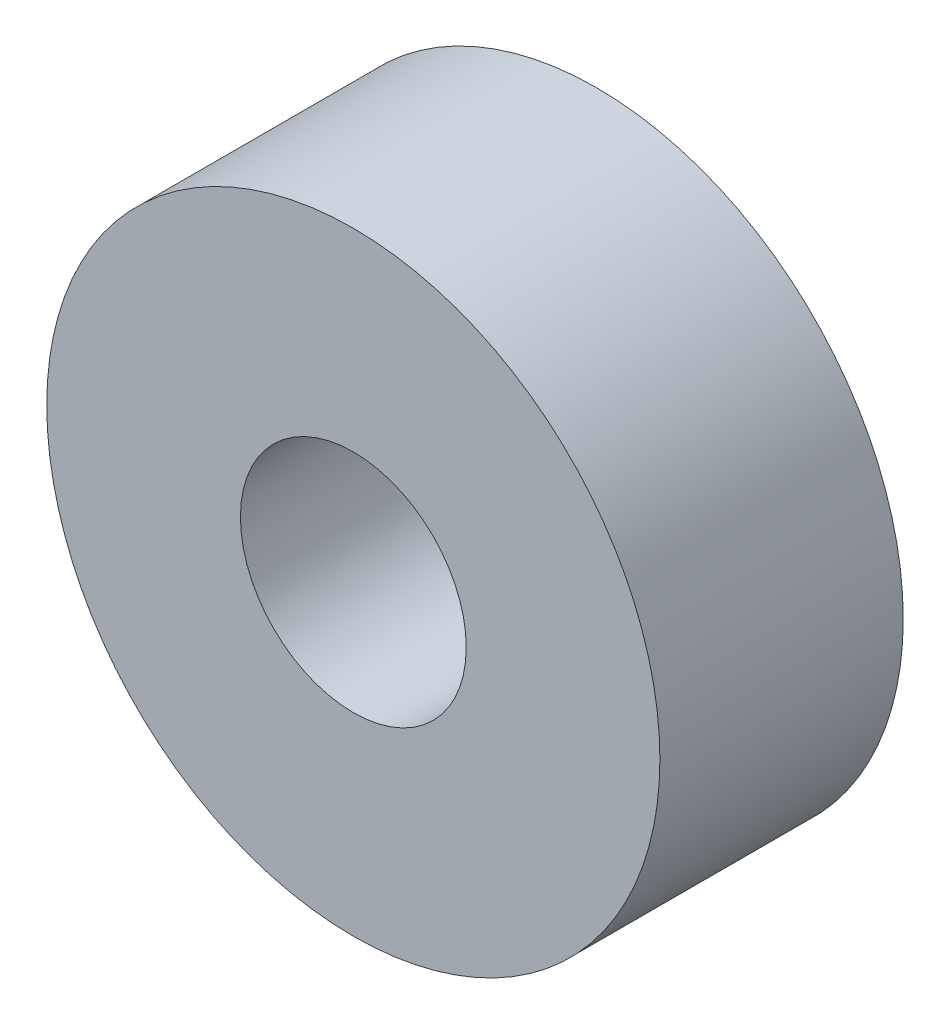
from build123d import *

# Parameters (mm, degrees)
SKETCH1_R           = 4
SKETCH1_R_2         = 1.4732
BOSS_EXTRUDE1_DEPTH = 3.175


with BuildPart() as part:
    # Sketch1 → Boss-Extrude1 (new body)
    with BuildSketch(Plane.XY):
        Circle(SKETCH1_R)
        Circle(SKETCH1_R_2, mode=Mode.SUBTRACT)
    extrude(amount=BOSS_EXTRUDE1_DEPTH)


solid = part.part
